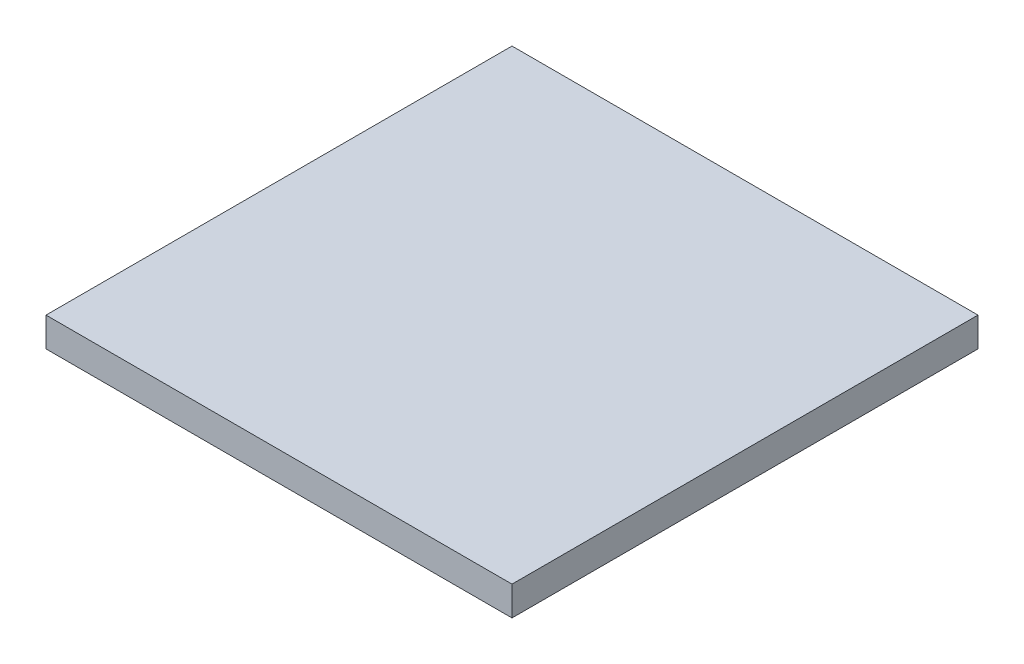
from build123d import *

# Parameters (mm, degrees)
SKETCH1_W           = 15.9
SKETCH1_H           = 15.9
BOSS_EXTRUDE1_DEPTH = 1


with BuildPart() as part:
    # Sketch1 → Boss-Extrude1 (new body)
    with BuildSketch(Plane(origin=(0, 0, 0), x_dir=(1, 0, 0), z_dir=(0, 1, 0))):
        Rectangle(SKETCH1_W, SKETCH1_H)
    extrude(amount=BOSS_EXTRUDE1_DEPTH)


solid = part.part
